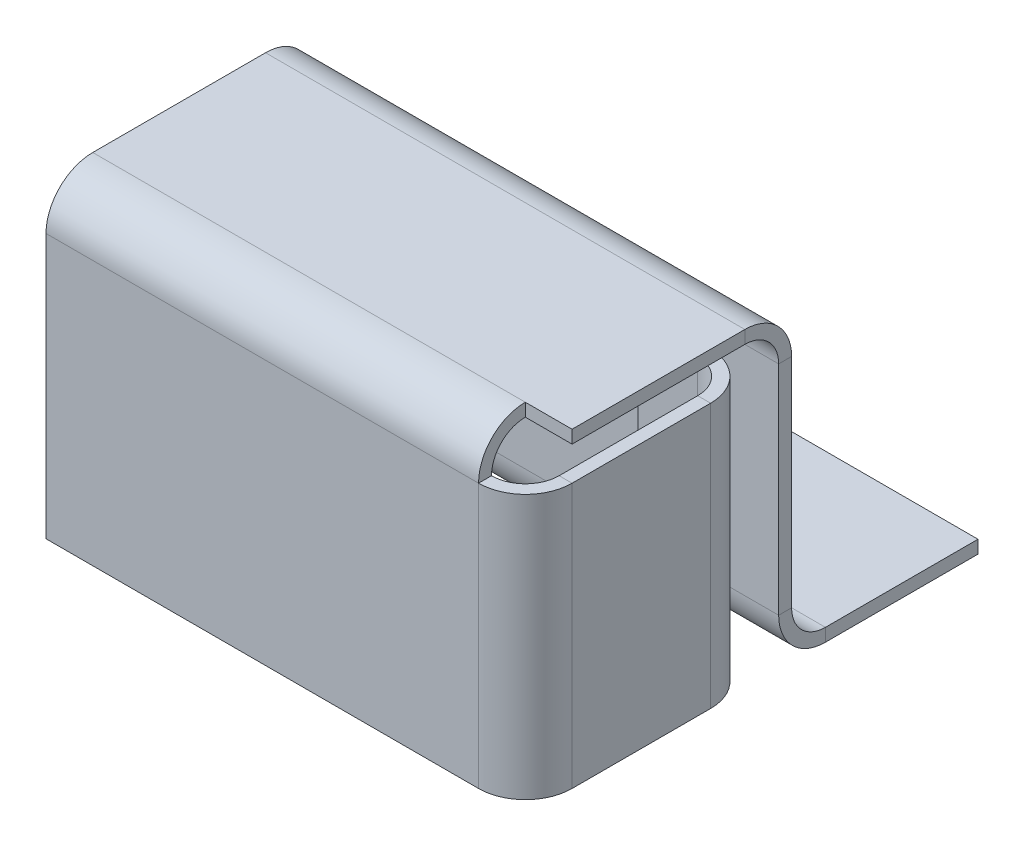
ISO-10303-21;
HEADER;
FILE_DESCRIPTION(('STEP AP214'),'2;1');
FILE_NAME('part.step','',(''),(''),'','','');
FILE_SCHEMA(('AUTOMOTIVE_DESIGN { 1 0 10303 214 1 1 1 1 }'));
ENDSEC;
DATA;
#1=APPLICATION_CONTEXT('core data for automotive mechanical design processes');
#2=APPLICATION_PROTOCOL_DEFINITION('international standard','automotive_design',2000,#1);
#3=PRODUCT_CONTEXT('',#1,'mechanical');
#4=PRODUCT('Part','Part','',(#3));
#5=PRODUCT_RELATED_PRODUCT_CATEGORY('part','',(#4));
#6=PRODUCT_DEFINITION_FORMATION('','',#4);
#7=PRODUCT_DEFINITION_CONTEXT('part definition',#1,'design');
#8=PRODUCT_DEFINITION('design','',#6,#7);
#9=PRODUCT_DEFINITION_SHAPE('','',#8);
#10=(LENGTH_UNIT() NAMED_UNIT(*) SI_UNIT(.MILLI.,.METRE.));
#11=(NAMED_UNIT(*) PLANE_ANGLE_UNIT() SI_UNIT($,.RADIAN.));
#12=(NAMED_UNIT(*) SI_UNIT($,.STERADIAN.) SOLID_ANGLE_UNIT());
#13=UNCERTAINTY_MEASURE_WITH_UNIT(LENGTH_MEASURE(1.E-05),#10,'distance_accuracy_value','');
#14=(GEOMETRIC_REPRESENTATION_CONTEXT(3) GLOBAL_UNCERTAINTY_ASSIGNED_CONTEXT((#13)) GLOBAL_UNIT_ASSIGNED_CONTEXT((#10,
#11,#12)) REPRESENTATION_CONTEXT('',''));
#15=CARTESIAN_POINT('',(0.,0.,0.));
#16=DIRECTION('',(0.,0.,1.));
#17=DIRECTION('',(1.,0.,0.));
#18=AXIS2_PLACEMENT_3D('',#15,#16,#17);
#19=CARTESIAN_POINT('',(45.,23.61088,41.28588));
#20=DIRECTION('',(0.,-1.,0.));
#21=DIRECTION('',(0.,0.,-1.));
#22=AXIS2_PLACEMENT_3D('',#19,#20,#21);
#23=PLANE('',#22);
#24=DIRECTION('',(1.,0.,0.));
#25=VECTOR('',#24,1.);
#26=CARTESIAN_POINT('',(43.7858800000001,23.61088,25.10324));
#27=LINE('',#26,#25);
#28=CARTESIAN_POINT('',(43.7858800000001,23.61088,25.10324));
#29=VERTEX_POINT('',#28);
#30=CARTESIAN_POINT('',(45.0000000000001,23.61088,25.10324));
#31=VERTEX_POINT('',#30);
#32=EDGE_CURVE('E308',#29,#31,#27,.T.);
#33=ORIENTED_EDGE('',*,*,#32,.F.);
#34=DIRECTION('',(0.,0.,-1.));
#35=VECTOR('',#34,1.);
#36=CARTESIAN_POINT('',(43.78588,23.61088,41.28588));
#37=LINE('',#36,#35);
#38=CARTESIAN_POINT('',(43.78588,23.61088,38.11088));
#39=VERTEX_POINT('',#38);
#40=EDGE_CURVE('E321',#29,#39,#37,.F.);
#41=ORIENTED_EDGE('',*,*,#40,.T.);
#42=DIRECTION('',(-1.,0.,0.));
#43=VECTOR('',#42,1.);
#44=CARTESIAN_POINT('',(45.,23.61088,38.11088));
#45=LINE('',#44,#43);
#46=CARTESIAN_POINT('',(45.,23.61088,38.11088));
#47=VERTEX_POINT('',#46);
#48=EDGE_CURVE('E311',#39,#47,#45,.F.);
#49=ORIENTED_EDGE('',*,*,#48,.T.);
#50=DIRECTION('',(0.,0.,1.));
#51=VECTOR('',#50,1.);
#52=CARTESIAN_POINT('',(45.0000000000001,23.61088,1.63988930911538E-13));
#53=LINE('',#52,#51);
#54=EDGE_CURVE('E317',#31,#47,#53,.T.);
#55=ORIENTED_EDGE('',*,*,#54,.F.);
#56=EDGE_LOOP('',(#33,#41,#49,#55));
#57=FACE_BOUND('',#56,.T.);
#58=ADVANCED_FACE('F78',(#57),#23,.F.);
#59=CARTESIAN_POINT('',(45.0000000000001,-1.21412,20.71412));
#60=DIRECTION('',(0.,1.,0.));
#61=DIRECTION('',(0.,0.,1.));
#62=AXIS2_PLACEMENT_3D('',#59,#60,#61);
#63=PLANE('',#62);
#64=DIRECTION('',(1.,0.,0.));
#65=VECTOR('',#64,1.);
#66=CARTESIAN_POINT('',(43.7858800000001,-1.21412,25.10324));
#67=LINE('',#66,#65);
#68=CARTESIAN_POINT('',(43.7858800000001,-1.21412,25.10324));
#69=VERTEX_POINT('',#68);
#70=CARTESIAN_POINT('',(45.0000000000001,-1.21412,25.10324));
#71=VERTEX_POINT('',#70);
#72=EDGE_CURVE('E302',#69,#71,#67,.T.);
#73=ORIENTED_EDGE('',*,*,#72,.T.);
#74=DIRECTION('',(0.,0.,-1.));
#75=VECTOR('',#74,1.);
#76=CARTESIAN_POINT('',(45.0000000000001,-1.21411999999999,1.5547463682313E-13));
#77=LINE('',#76,#75);
#78=CARTESIAN_POINT('',(45.,-1.21412,38.11088));
#79=VERTEX_POINT('',#78);
#80=EDGE_CURVE('E314',#79,#71,#77,.T.);
#81=ORIENTED_EDGE('',*,*,#80,.F.);
#82=DIRECTION('',(-1.,0.,0.));
#83=VECTOR('',#82,1.);
#84=CARTESIAN_POINT('',(43.78588,-1.21412,38.11088));
#85=LINE('',#84,#83);
#86=CARTESIAN_POINT('',(43.78588,-1.21412,38.11088));
#87=VERTEX_POINT('',#86);
#88=EDGE_CURVE('E326',#87,#79,#85,.F.);
#89=ORIENTED_EDGE('',*,*,#88,.F.);
#90=DIRECTION('',(0.,0.,1.));
#91=VECTOR('',#90,1.);
#92=CARTESIAN_POINT('',(43.7858800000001,-1.21412,20.71412));
#93=LINE('',#92,#91);
#94=EDGE_CURVE('E319',#87,#69,#93,.F.);
#95=ORIENTED_EDGE('',*,*,#94,.T.);
#96=EDGE_LOOP('',(#73,#81,#89,#95));
#97=FACE_BOUND('',#96,.T.);
#98=ADVANCED_FACE('F532',(#97),#63,.F.);
#99=CARTESIAN_POINT('',(45.0000000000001,0.,1.56024936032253E-13));
#100=DIRECTION('',(-1.,0.,0.));
#101=DIRECTION('',(0.,0.,1.));
#102=AXIS2_PLACEMENT_3D('',#99,#100,#101);
#103=PLANE('',#102);
#104=DIRECTION('',(0.,-1.,0.));
#105=VECTOR('',#104,1.);
#106=CARTESIAN_POINT('',(45.0000000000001,-1.21412,25.10324));
#107=LINE('',#106,#105);
#108=EDGE_CURVE('E252',#71,#31,#107,.F.);
#109=ORIENTED_EDGE('',*,*,#108,.T.);
#110=ORIENTED_EDGE('',*,*,#54,.T.);
#111=DIRECTION('',(0.,-1.,0.));
#112=VECTOR('',#111,1.);
#113=CARTESIAN_POINT('',(45.,23.61088,38.11088));
#114=LINE('',#113,#112);
#115=EDGE_CURVE('E323',#79,#47,#114,.F.);
#116=ORIENTED_EDGE('',*,*,#115,.F.);
#117=ORIENTED_EDGE('',*,*,#80,.T.);
#118=EDGE_LOOP('',(#109,#110,#116,#117));
#119=FACE_BOUND('',#118,.T.);
#120=ADVANCED_FACE('F528',(#119),#103,.F.);
#121=CARTESIAN_POINT('',(43.7858800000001,0.,1.51785858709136E-13));
#122=DIRECTION('',(-1.,0.,0.));
#123=DIRECTION('',(0.,0.,1.));
#124=AXIS2_PLACEMENT_3D('',#121,#122,#123);
#125=PLANE('',#124);
#126=ORIENTED_EDGE('',*,*,#40,.F.);
#127=DIRECTION('',(0.,-1.,0.));
#128=VECTOR('',#127,1.);
#129=CARTESIAN_POINT('',(43.7858800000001,-1.21412,25.10324));
#130=LINE('',#129,#128);
#131=EDGE_CURVE('E93',#69,#29,#130,.F.);
#132=ORIENTED_EDGE('',*,*,#131,.F.);
#133=ORIENTED_EDGE('',*,*,#94,.F.);
#134=DIRECTION('',(0.,-1.,0.));
#135=VECTOR('',#134,1.);
#136=CARTESIAN_POINT('',(43.78588,23.61088,38.11088));
#137=LINE('',#136,#135);
#138=EDGE_CURVE('E329',#39,#87,#137,.T.);
#139=ORIENTED_EDGE('',*,*,#138,.F.);
#140=EDGE_LOOP('',(#126,#132,#133,#139));
#141=FACE_BOUND('',#140,.T.);
#142=ADVANCED_FACE('F863',(#141),#125,.T.);
#143=CARTESIAN_POINT('',(0.,0.,38.11088));
#144=DIRECTION('',(0.,0.,1.));
#145=DIRECTION('',(1.,0.,0.));
#146=AXIS2_PLACEMENT_3D('',#143,#144,#145);
#147=PLANE('',#146);
#148=DIRECTION('',(0.,1.,0.));
#149=VECTOR('',#148,1.);
#150=CARTESIAN_POINT('',(40.61088,26.78588,38.11088));
#151=LINE('',#150,#149);
#152=CARTESIAN_POINT('',(40.61088,26.78588,38.11088));
#153=VERTEX_POINT('',#152);
#154=CARTESIAN_POINT('',(40.61088,28.,38.11088));
#155=VERTEX_POINT('',#154);
#156=EDGE_CURVE('E13',#153,#155,#151,.T.);
#157=ORIENTED_EDGE('',*,*,#156,.F.);
#158=DIRECTION('',(-1.,0.,0.));
#159=VECTOR('',#158,1.);
#160=CARTESIAN_POINT('',(45.,26.78588,38.11088));
#161=LINE('',#160,#159);
#162=CARTESIAN_POINT('',(45.,26.78588,38.11088));
#163=VERTEX_POINT('',#162);
#164=EDGE_CURVE('E472',#163,#153,#161,.T.);
#165=ORIENTED_EDGE('',*,*,#164,.F.);
#166=DIRECTION('',(0.,-1.,0.));
#167=VECTOR('',#166,1.);
#168=CARTESIAN_POINT('',(45.,28.,38.11088));
#169=LINE('',#168,#167);
#170=CARTESIAN_POINT('',(45.,28.,38.11088));
#171=VERTEX_POINT('',#170);
#172=EDGE_CURVE('E487',#171,#163,#169,.T.);
#173=ORIENTED_EDGE('',*,*,#172,.F.);
#174=DIRECTION('',(-1.,0.,0.));
#175=VECTOR('',#174,1.);
#176=CARTESIAN_POINT('',(45.,28.,38.11088));
#177=LINE('',#176,#175);
#178=EDGE_CURVE('E440',#171,#155,#177,.T.);
#179=ORIENTED_EDGE('',*,*,#178,.T.);
#180=EDGE_LOOP('',(#157,#165,#173,#179));
#181=FACE_BOUND('',#180,.T.);
#182=ADVANCED_FACE('F80',(#181),#147,.T.);
#183=CARTESIAN_POINT('',(45.,23.61088,38.11088));
#184=DIRECTION('',(-1.,0.,0.));
#185=DIRECTION('',(0.,0.,1.));
#186=AXIS2_PLACEMENT_3D('',#183,#184,#185);
#187=CYLINDRICAL_SURFACE('',#186,3.175);
#188=CARTESIAN_POINT('',(0.,26.78588,38.11088));
#189=VERTEX_POINT('',#188);
#190=EDGE_CURVE('E471',#153,#189,#161,.T.);
#191=ORIENTED_EDGE('',*,*,#190,.F.);
#192=CARTESIAN_POINT('',(40.61088,23.61088,38.11088));
#193=DIRECTION('',(1.,0.,0.));
#194=DIRECTION('',(0.,0.,-1.));
#195=AXIS2_PLACEMENT_3D('',#192,#193,#194);
#196=CIRCLE('',#195,3.175);
#197=CARTESIAN_POINT('',(40.61088,23.61088,41.28588));
#198=VERTEX_POINT('',#197);
#199=EDGE_CURVE('E505',#153,#198,#196,.T.);
#200=ORIENTED_EDGE('',*,*,#199,.T.);
#201=DIRECTION('',(-1.,0.,0.));
#202=VECTOR('',#201,1.);
#203=CARTESIAN_POINT('',(45.,23.61088,41.28588));
#204=LINE('',#203,#202);
#205=CARTESIAN_POINT('',(0.,23.61088,41.28588));
#206=VERTEX_POINT('',#205);
#207=EDGE_CURVE('E475',#198,#206,#204,.T.);
#208=ORIENTED_EDGE('',*,*,#207,.T.);
#209=CARTESIAN_POINT('',(0.,23.61088,38.11088));
#210=DIRECTION('',(1.,0.,0.));
#211=DIRECTION('',(0.,0.,-1.));
#212=AXIS2_PLACEMENT_3D('',#209,#210,#211);
#213=CIRCLE('',#212,3.175);
#214=EDGE_CURVE('E400',#189,#206,#213,.T.);
#215=ORIENTED_EDGE('',*,*,#214,.F.);
#216=EDGE_LOOP('',(#191,#200,#208,#215));
#217=FACE_BOUND('',#216,.T.);
#218=ADVANCED_FACE('F626',(#217),#187,.F.);
#219=CARTESIAN_POINT('',(45.,28.,42.5));
#220=DIRECTION('',(0.,0.,-1.));
#221=DIRECTION('',(0.,1.,0.));
#222=AXIS2_PLACEMENT_3D('',#219,#220,#221);
#223=PLANE('',#222);
#224=DIRECTION('',(0.,-1.,0.));
#225=VECTOR('',#224,1.);
#226=CARTESIAN_POINT('',(40.61088,-1.21412000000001,42.5));
#227=LINE('',#226,#225);
#228=CARTESIAN_POINT('',(40.61088,-1.21412000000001,42.5));
#229=VERTEX_POINT('',#228);
#230=CARTESIAN_POINT('',(40.61088,23.61088,42.5));
#231=VERTEX_POINT('',#230);
#232=EDGE_CURVE('E333',#229,#231,#227,.F.);
#233=ORIENTED_EDGE('',*,*,#232,.T.);
#234=DIRECTION('',(-1.,0.,0.));
#235=VECTOR('',#234,1.);
#236=CARTESIAN_POINT('',(45.,23.61088,42.5));
#237=LINE('',#236,#235);
#238=CARTESIAN_POINT('',(0.,23.61088,42.5));
#239=VERTEX_POINT('',#238);
#240=EDGE_CURVE('E391',#231,#239,#237,.T.);
#241=ORIENTED_EDGE('',*,*,#240,.T.);
#242=DIRECTION('',(0.,-1.,0.));
#243=VECTOR('',#242,1.);
#244=CARTESIAN_POINT('',(0.,28.,42.5));
#245=LINE('',#244,#243);
#246=CARTESIAN_POINT('',(0.,-1.21412000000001,42.5));
#247=VERTEX_POINT('',#246);
#248=EDGE_CURVE('E354',#239,#247,#245,.T.);
#249=ORIENTED_EDGE('',*,*,#248,.T.);
#250=DIRECTION('',(-1.,0.,0.));
#251=VECTOR('',#250,1.);
#252=CARTESIAN_POINT('',(45.,-1.21412000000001,42.5));
#253=LINE('',#252,#251);
#254=EDGE_CURVE('E479',#229,#247,#253,.T.);
#255=ORIENTED_EDGE('',*,*,#254,.F.);
#256=EDGE_LOOP('',(#233,#241,#249,#255));
#257=FACE_BOUND('',#256,.T.);
#258=ADVANCED_FACE('F513',(#257),#223,.F.);
#259=CARTESIAN_POINT('',(45.,-1.21412000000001,41.28588));
#260=DIRECTION('',(0.,-1.,0.));
#261=DIRECTION('',(0.,0.,-1.));
#262=AXIS2_PLACEMENT_3D('',#259,#260,#261);
#263=PLANE('',#262);
#264=DIRECTION('',(-1.,0.,0.));
#265=VECTOR('',#264,1.);
#266=CARTESIAN_POINT('',(45.,-1.21412000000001,41.28588));
#267=LINE('',#266,#265);
#268=CARTESIAN_POINT('',(40.61088,-1.21412000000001,41.28588));
#269=VERTEX_POINT('',#268);
#270=CARTESIAN_POINT('',(0.,-1.21412000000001,41.28588));
#271=VERTEX_POINT('',#270);
#272=EDGE_CURVE('E477',#269,#271,#267,.T.);
#273=ORIENTED_EDGE('',*,*,#272,.F.);
#274=DIRECTION('',(0.,0.,1.));
#275=VECTOR('',#274,1.);
#276=CARTESIAN_POINT('',(40.61088,-1.21412000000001,41.28588));
#277=LINE('',#276,#275);
#278=EDGE_CURVE('E340',#269,#229,#277,.T.);
#279=ORIENTED_EDGE('',*,*,#278,.T.);
#280=ORIENTED_EDGE('',*,*,#254,.T.);
#281=DIRECTION('',(0.,0.,1.));
#282=VECTOR('',#281,1.);
#283=CARTESIAN_POINT('',(0.,-1.21412000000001,41.28588));
#284=LINE('',#283,#282);
#285=EDGE_CURVE('E394',#271,#247,#284,.T.);
#286=ORIENTED_EDGE('',*,*,#285,.F.);
#287=EDGE_LOOP('',(#273,#279,#280,#286));
#288=FACE_BOUND('',#287,.T.);
#289=ADVANCED_FACE('F634',(#288),#263,.T.);
#290=CARTESIAN_POINT('',(45.,28.,41.28588));
#291=DIRECTION('',(0.,0.,-1.));
#292=DIRECTION('',(0.,1.,0.));
#293=AXIS2_PLACEMENT_3D('',#290,#291,#292);
#294=PLANE('',#293);
#295=ORIENTED_EDGE('',*,*,#207,.F.);
#296=DIRECTION('',(0.,-1.,0.));
#297=VECTOR('',#296,1.);
#298=CARTESIAN_POINT('',(40.61088,-1.21412000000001,41.28588));
#299=LINE('',#298,#297);
#300=EDGE_CURVE('E346',#269,#198,#299,.F.);
#301=ORIENTED_EDGE('',*,*,#300,.F.);
#302=ORIENTED_EDGE('',*,*,#272,.T.);
#303=DIRECTION('',(0.,-1.,0.));
#304=VECTOR('',#303,1.);
#305=CARTESIAN_POINT('',(0.,28.,41.28588));
#306=LINE('',#305,#304);
#307=EDGE_CURVE('E397',#206,#271,#306,.T.);
#308=ORIENTED_EDGE('',*,*,#307,.F.);
#309=EDGE_LOOP('',(#295,#301,#302,#308));
#310=FACE_BOUND('',#309,.T.);
#311=ADVANCED_FACE('F630',(#310),#294,.T.);
#312=CARTESIAN_POINT('',(45.,0.,14.325));
#313=DIRECTION('',(1.,0.,0.));
#314=DIRECTION('',(0.,0.,-1.));
#315=AXIS2_PLACEMENT_3D('',#312,#313,#314);
#316=PLANE('',#315);
#317=DIRECTION('',(0.,-1.,0.));
#318=VECTOR('',#317,1.);
#319=CARTESIAN_POINT('',(45.,0.,14.325));
#320=LINE('',#319,#318);
#321=CARTESIAN_POINT('',(45.,0.,14.325));
#322=VERTEX_POINT('',#321);
#323=CARTESIAN_POINT('',(45.,-1.21412,14.325));
#324=VERTEX_POINT('',#323);
#325=EDGE_CURVE('E503',#322,#324,#320,.T.);
#326=ORIENTED_EDGE('',*,*,#325,.F.);
#327=CARTESIAN_POINT('',(45.,3.175,14.325));
#328=DIRECTION('',(1.,0.,0.));
#329=DIRECTION('',(0.,0.,-1.));
#330=AXIS2_PLACEMENT_3D('',#327,#328,#329);
#331=CIRCLE('',#330,3.175);
#332=CARTESIAN_POINT('',(45.,3.175,17.5));
#333=VERTEX_POINT('',#332);
#334=EDGE_CURVE('E379',#322,#333,#331,.F.);
#335=ORIENTED_EDGE('',*,*,#334,.T.);
#336=DIRECTION('',(0.,0.,-1.));
#337=VECTOR('',#336,1.);
#338=CARTESIAN_POINT('',(45.,3.175,18.71412));
#339=LINE('',#338,#337);
#340=CARTESIAN_POINT('',(45.,3.175,18.71412));
#341=VERTEX_POINT('',#340);
#342=EDGE_CURVE('E501',#341,#333,#339,.T.);
#343=ORIENTED_EDGE('',*,*,#342,.F.);
#344=CARTESIAN_POINT('',(45.,3.175,14.325));
#345=DIRECTION('',(1.,0.,0.));
#346=DIRECTION('',(0.,0.,-1.));
#347=AXIS2_PLACEMENT_3D('',#344,#345,#346);
#348=CIRCLE('',#347,4.38912);
#349=EDGE_CURVE('E367',#324,#341,#348,.F.);
#350=ORIENTED_EDGE('',*,*,#349,.F.);
#351=EDGE_LOOP('',(#326,#335,#343,#350));
#352=FACE_BOUND('',#351,.T.);
#353=ADVANCED_FACE('F633',(#352),#316,.T.);
#354=CARTESIAN_POINT('',(45.,3.175,18.71412));
#355=DIRECTION('',(1.,0.,0.));
#356=DIRECTION('',(0.,0.,-1.));
#357=AXIS2_PLACEMENT_3D('',#354,#355,#356);
#358=PLANE('',#357);
#359=DIRECTION('',(0.,0.,1.));
#360=VECTOR('',#359,1.);
#361=CARTESIAN_POINT('',(45.,0.,0.));
#362=LINE('',#361,#360);
#363=CARTESIAN_POINT('',(45.,0.,0.));
#364=VERTEX_POINT('',#363);
#365=EDGE_CURVE('E376',#364,#322,#362,.T.);
#366=ORIENTED_EDGE('',*,*,#365,.T.);
#367=ORIENTED_EDGE('',*,*,#325,.T.);
#368=DIRECTION('',(0.,0.,1.));
#369=VECTOR('',#368,1.);
#370=CARTESIAN_POINT('',(45.,-1.21412,0.));
#371=LINE('',#370,#369);
#372=CARTESIAN_POINT('',(45.,-1.21412,0.));
#373=VERTEX_POINT('',#372);
#374=EDGE_CURVE('E370',#373,#324,#371,.T.);
#375=ORIENTED_EDGE('',*,*,#374,.F.);
#376=DIRECTION('',(0.,-1.,0.));
#377=VECTOR('',#376,1.);
#378=CARTESIAN_POINT('',(45.,0.,0.));
#379=LINE('',#378,#377);
#380=EDGE_CURVE('E373',#364,#373,#379,.T.);
#381=ORIENTED_EDGE('',*,*,#380,.F.);
#382=EDGE_LOOP('',(#366,#367,#375,#381));
#383=FACE_BOUND('',#382,.T.);
#384=ADVANCED_FACE('F676',(#383),#358,.T.);
#385=CARTESIAN_POINT('',(0.,3.175,17.5));
#386=DIRECTION('',(-1.,0.,0.));
#387=DIRECTION('',(0.,0.,1.));
#388=AXIS2_PLACEMENT_3D('',#385,#386,#387);
#389=PLANE('',#388);
#390=DIRECTION('',(0.,0.,1.));
#391=VECTOR('',#390,1.);
#392=CARTESIAN_POINT('',(0.,3.175,17.5));
#393=LINE('',#392,#391);
#394=CARTESIAN_POINT('',(0.,3.175,17.5));
#395=VERTEX_POINT('',#394);
#396=CARTESIAN_POINT('',(0.,3.175,18.71412));
#397=VERTEX_POINT('',#396);
#398=EDGE_CURVE('E499',#395,#397,#393,.T.);
#399=ORIENTED_EDGE('',*,*,#398,.F.);
#400=CARTESIAN_POINT('',(0.,3.175,14.325));
#401=DIRECTION('',(1.,0.,0.));
#402=DIRECTION('',(0.,0.,-1.));
#403=AXIS2_PLACEMENT_3D('',#400,#401,#402);
#404=CIRCLE('',#403,3.175);
#405=CARTESIAN_POINT('',(0.,0.,14.325));
#406=VERTEX_POINT('',#405);
#407=EDGE_CURVE('E424',#406,#395,#404,.F.);
#408=ORIENTED_EDGE('',*,*,#407,.F.);
#409=DIRECTION('',(0.,1.,0.));
#410=VECTOR('',#409,1.);
#411=CARTESIAN_POINT('',(0.,-1.21412,14.325));
#412=LINE('',#411,#410);
#413=CARTESIAN_POINT('',(0.,-1.21412,14.325));
#414=VERTEX_POINT('',#413);
#415=EDGE_CURVE('E497',#414,#406,#412,.T.);
#416=ORIENTED_EDGE('',*,*,#415,.F.);
#417=CARTESIAN_POINT('',(0.,3.175,14.325));
#418=DIRECTION('',(1.,0.,0.));
#419=DIRECTION('',(0.,0.,-1.));
#420=AXIS2_PLACEMENT_3D('',#417,#418,#419);
#421=CIRCLE('',#420,4.38912);
#422=EDGE_CURVE('E412',#414,#397,#421,.F.);
#423=ORIENTED_EDGE('',*,*,#422,.T.);
#424=EDGE_LOOP('',(#399,#408,#416,#423));
#425=FACE_BOUND('',#424,.T.);
#426=ADVANCED_FACE('F672',(#425),#389,.T.);
#427=CARTESIAN_POINT('',(0.,-1.21412,14.325));
#428=DIRECTION('',(-1.,0.,0.));
#429=DIRECTION('',(0.,0.,1.));
#430=AXIS2_PLACEMENT_3D('',#427,#428,#429);
#431=PLANE('',#430);
#432=DIRECTION('',(0.,1.,0.));
#433=VECTOR('',#432,1.);
#434=CARTESIAN_POINT('',(0.,0.,17.5));
#435=LINE('',#434,#433);
#436=CARTESIAN_POINT('',(0.,23.61088,17.5));
#437=VERTEX_POINT('',#436);
#438=EDGE_CURVE('E427',#395,#437,#435,.T.);
#439=ORIENTED_EDGE('',*,*,#438,.F.);
#440=ORIENTED_EDGE('',*,*,#398,.T.);
#441=DIRECTION('',(0.,1.,0.));
#442=VECTOR('',#441,1.);
#443=CARTESIAN_POINT('',(0.,0.,18.71412));
#444=LINE('',#443,#442);
#445=CARTESIAN_POINT('',(0.,23.61088,18.71412));
#446=VERTEX_POINT('',#445);
#447=EDGE_CURVE('E409',#397,#446,#444,.T.);
#448=ORIENTED_EDGE('',*,*,#447,.T.);
#449=DIRECTION('',(0.,0.,-1.));
#450=VECTOR('',#449,1.);
#451=CARTESIAN_POINT('',(0.,23.61088,18.71412));
#452=LINE('',#451,#450);
#453=EDGE_CURVE('E489',#446,#437,#452,.T.);
#454=ORIENTED_EDGE('',*,*,#453,.T.);
#455=EDGE_LOOP('',(#439,#440,#448,#454));
#456=FACE_BOUND('',#455,.T.);
#457=ADVANCED_FACE('F668',(#456),#431,.T.);
#458=CARTESIAN_POINT('',(45.,23.61088,17.5));
#459=DIRECTION('',(1.,0.,0.));
#460=DIRECTION('',(0.,0.,-1.));
#461=AXIS2_PLACEMENT_3D('',#458,#459,#460);
#462=PLANE('',#461);
#463=DIRECTION('',(0.,0.,1.));
#464=VECTOR('',#463,1.);
#465=CARTESIAN_POINT('',(45.,23.61088,17.5));
#466=LINE('',#465,#464);
#467=CARTESIAN_POINT('',(45.,23.61088,17.5));
#468=VERTEX_POINT('',#467);
#469=CARTESIAN_POINT('',(45.,23.61088,18.71412));
#470=VERTEX_POINT('',#469);
#471=EDGE_CURVE('E495',#468,#470,#466,.T.);
#472=ORIENTED_EDGE('',*,*,#471,.F.);
#473=CARTESIAN_POINT('',(45.,23.61088,21.88912));
#474=DIRECTION('',(-1.,0.,0.));
#475=DIRECTION('',(0.,0.,1.));
#476=AXIS2_PLACEMENT_3D('',#473,#474,#475);
#477=CIRCLE('',#476,4.38912);
#478=CARTESIAN_POINT('',(45.,28.,21.88912));
#479=VERTEX_POINT('',#478);
#480=EDGE_CURVE('E385',#468,#479,#477,.F.);
#481=ORIENTED_EDGE('',*,*,#480,.T.);
#482=DIRECTION('',(0.,1.,0.));
#483=VECTOR('',#482,1.);
#484=CARTESIAN_POINT('',(45.,26.78588,21.88912));
#485=LINE('',#484,#483);
#486=CARTESIAN_POINT('',(45.,26.78588,21.88912));
#487=VERTEX_POINT('',#486);
#488=EDGE_CURVE('E493',#487,#479,#485,.T.);
#489=ORIENTED_EDGE('',*,*,#488,.F.);
#490=CARTESIAN_POINT('',(45.,23.61088,21.88912));
#491=DIRECTION('',(1.,0.,0.));
#492=DIRECTION('',(0.,0.,-1.));
#493=AXIS2_PLACEMENT_3D('',#490,#491,#492);
#494=CIRCLE('',#493,3.175);
#495=EDGE_CURVE('E360',#470,#487,#494,.T.);
#496=ORIENTED_EDGE('',*,*,#495,.F.);
#497=EDGE_LOOP('',(#472,#481,#489,#496));
#498=FACE_BOUND('',#497,.T.);
#499=ADVANCED_FACE('F664',(#498),#462,.T.);
#500=CARTESIAN_POINT('',(45.,26.78588,21.88912));
#501=DIRECTION('',(1.,0.,0.));
#502=DIRECTION('',(0.,0.,-1.));
#503=AXIS2_PLACEMENT_3D('',#500,#501,#502);
#504=PLANE('',#503);
#505=DIRECTION('',(0.,1.,0.));
#506=VECTOR('',#505,1.);
#507=CARTESIAN_POINT('',(45.,0.,17.5));
#508=LINE('',#507,#506);
#509=EDGE_CURVE('E382',#333,#468,#508,.T.);
#510=ORIENTED_EDGE('',*,*,#509,.T.);
#511=ORIENTED_EDGE('',*,*,#471,.T.);
#512=DIRECTION('',(0.,1.,0.));
#513=VECTOR('',#512,1.);
#514=CARTESIAN_POINT('',(45.,0.,18.71412));
#515=LINE('',#514,#513);
#516=EDGE_CURVE('E364',#341,#470,#515,.T.);
#517=ORIENTED_EDGE('',*,*,#516,.F.);
#518=ORIENTED_EDGE('',*,*,#342,.T.);
#519=EDGE_LOOP('',(#510,#511,#517,#518));
#520=FACE_BOUND('',#519,.T.);
#521=ADVANCED_FACE('F660',(#520),#504,.T.);
#522=CARTESIAN_POINT('',(0.,28.,21.88912));
#523=DIRECTION('',(-1.,0.,0.));
#524=DIRECTION('',(0.,0.,1.));
#525=AXIS2_PLACEMENT_3D('',#522,#523,#524);
#526=PLANE('',#525);
#527=DIRECTION('',(0.,-1.,0.));
#528=VECTOR('',#527,1.);
#529=CARTESIAN_POINT('',(0.,28.,21.88912));
#530=LINE('',#529,#528);
#531=CARTESIAN_POINT('',(0.,28.,21.88912));
#532=VERTEX_POINT('',#531);
#533=CARTESIAN_POINT('',(0.,26.78588,21.88912));
#534=VERTEX_POINT('',#533);
#535=EDGE_CURVE('E491',#532,#534,#530,.T.);
#536=ORIENTED_EDGE('',*,*,#535,.F.);
#537=CARTESIAN_POINT('',(0.,23.61088,21.88912));
#538=DIRECTION('',(-1.,0.,0.));
#539=DIRECTION('',(0.,0.,1.));
#540=AXIS2_PLACEMENT_3D('',#537,#538,#539);
#541=CIRCLE('',#540,4.38912);
#542=EDGE_CURVE('E430',#437,#532,#541,.F.);
#543=ORIENTED_EDGE('',*,*,#542,.F.);
#544=ORIENTED_EDGE('',*,*,#453,.F.);
#545=CARTESIAN_POINT('',(0.,23.61088,21.88912));
#546=DIRECTION('',(1.,0.,0.));
#547=DIRECTION('',(0.,0.,-1.));
#548=AXIS2_PLACEMENT_3D('',#545,#546,#547);
#549=CIRCLE('',#548,3.175);
#550=EDGE_CURVE('E406',#446,#534,#549,.T.);
#551=ORIENTED_EDGE('',*,*,#550,.T.);
#552=EDGE_LOOP('',(#536,#543,#544,#551));
#553=FACE_BOUND('',#552,.T.);
#554=ADVANCED_FACE('F656',(#553),#526,.T.);
#555=CARTESIAN_POINT('',(0.,23.61088,18.71412));
#556=DIRECTION('',(-1.,0.,0.));
#557=DIRECTION('',(0.,0.,1.));
#558=AXIS2_PLACEMENT_3D('',#555,#556,#557);
#559=PLANE('',#558);
#560=DIRECTION('',(0.,0.,1.));
#561=VECTOR('',#560,1.);
#562=CARTESIAN_POINT('',(0.,28.,17.5));
#563=LINE('',#562,#561);
#564=CARTESIAN_POINT('',(0.,28.,38.11088));
#565=VERTEX_POINT('',#564);
#566=EDGE_CURVE('E433',#532,#565,#563,.T.);
#567=ORIENTED_EDGE('',*,*,#566,.F.);
#568=ORIENTED_EDGE('',*,*,#535,.T.);
#569=DIRECTION('',(0.,0.,1.));
#570=VECTOR('',#569,1.);
#571=CARTESIAN_POINT('',(0.,26.78588,17.5));
#572=LINE('',#571,#570);
#573=EDGE_CURVE('E403',#534,#189,#572,.T.);
#574=ORIENTED_EDGE('',*,*,#573,.T.);
#575=DIRECTION('',(0.,1.,0.));
#576=VECTOR('',#575,1.);
#577=CARTESIAN_POINT('',(0.,26.78588,38.11088));
#578=LINE('',#577,#576);
#579=EDGE_CURVE('E481',#189,#565,#578,.T.);
#580=ORIENTED_EDGE('',*,*,#579,.T.);
#581=EDGE_LOOP('',(#567,#568,#574,#580));
#582=FACE_BOUND('',#581,.T.);
#583=ADVANCED_FACE('F652',(#582),#559,.T.);
#584=CARTESIAN_POINT('',(45.,23.61088,41.28588));
#585=DIRECTION('',(1.,0.,0.));
#586=DIRECTION('',(0.,0.,-1.));
#587=AXIS2_PLACEMENT_3D('',#584,#585,#586);
#588=PLANE('',#587);
#589=DIRECTION('',(0.,0.,1.));
#590=VECTOR('',#589,1.);
#591=CARTESIAN_POINT('',(45.,28.,17.5));
#592=LINE('',#591,#590);
#593=EDGE_CURVE('E388',#479,#171,#592,.T.);
#594=ORIENTED_EDGE('',*,*,#593,.T.);
#595=ORIENTED_EDGE('',*,*,#172,.T.);
#596=DIRECTION('',(0.,0.,1.));
#597=VECTOR('',#596,1.);
#598=CARTESIAN_POINT('',(45.,26.78588,17.5));
#599=LINE('',#598,#597);
#600=EDGE_CURVE('E357',#487,#163,#599,.T.);
#601=ORIENTED_EDGE('',*,*,#600,.F.);
#602=ORIENTED_EDGE('',*,*,#488,.T.);
#603=EDGE_LOOP('',(#594,#595,#601,#602));
#604=FACE_BOUND('',#603,.T.);
#605=ADVANCED_FACE('F648',(#604),#588,.T.);
#606=CARTESIAN_POINT('',(0.,23.61088,42.5));
#607=DIRECTION('',(-1.,0.,0.));
#608=DIRECTION('',(0.,0.,1.));
#609=AXIS2_PLACEMENT_3D('',#606,#607,#608);
#610=PLANE('',#609);
#611=DIRECTION('',(0.,0.,-1.));
#612=VECTOR('',#611,1.);
#613=CARTESIAN_POINT('',(0.,23.61088,42.5));
#614=LINE('',#613,#612);
#615=EDGE_CURVE('E484',#239,#206,#614,.T.);
#616=ORIENTED_EDGE('',*,*,#615,.F.);
#617=CARTESIAN_POINT('',(0.,23.61088,38.11088));
#618=DIRECTION('',(-1.,0.,0.));
#619=DIRECTION('',(0.,0.,1.));
#620=AXIS2_PLACEMENT_3D('',#617,#618,#619);
#621=CIRCLE('',#620,4.38912);
#622=EDGE_CURVE('E361',#565,#239,#621,.F.);
#623=ORIENTED_EDGE('',*,*,#622,.F.);
#624=ORIENTED_EDGE('',*,*,#579,.F.);
#625=ORIENTED_EDGE('',*,*,#214,.T.);
#626=EDGE_LOOP('',(#616,#623,#624,#625));
#627=FACE_BOUND('',#626,.T.);
#628=ADVANCED_FACE('F644',(#627),#610,.T.);
#629=CARTESIAN_POINT('',(0.,26.78588,38.11088));
#630=DIRECTION('',(-1.,0.,0.));
#631=DIRECTION('',(0.,0.,1.));
#632=AXIS2_PLACEMENT_3D('',#629,#630,#631);
#633=PLANE('',#632);
#634=ORIENTED_EDGE('',*,*,#248,.F.);
#635=ORIENTED_EDGE('',*,*,#615,.T.);
#636=ORIENTED_EDGE('',*,*,#307,.T.);
#637=ORIENTED_EDGE('',*,*,#285,.T.);
#638=EDGE_LOOP('',(#634,#635,#636,#637));
#639=FACE_BOUND('',#638,.T.);
#640=ADVANCED_FACE('F641',(#639),#633,.T.);
#641=CARTESIAN_POINT('',(40.61088,23.61088,38.11088));
#642=DIRECTION('',(1.,0.,0.));
#643=DIRECTION('',(0.,0.,-1.));
#644=AXIS2_PLACEMENT_3D('',#641,#642,#643);
#645=PLANE('',#644);
#646=ORIENTED_EDGE('',*,*,#199,.F.);
#647=ORIENTED_EDGE('',*,*,#156,.T.);
#648=CARTESIAN_POINT('',(40.61088,23.61088,38.11088));
#649=DIRECTION('',(1.,0.,0.));
#650=DIRECTION('',(0.,0.,-1.));
#651=AXIS2_PLACEMENT_3D('',#648,#649,#650);
#652=CIRCLE('',#651,4.38912);
#653=EDGE_CURVE('E86',#155,#231,#652,.T.);
#654=ORIENTED_EDGE('',*,*,#653,.T.);
#655=DIRECTION('',(0.,0.,1.));
#656=VECTOR('',#655,1.);
#657=CARTESIAN_POINT('',(40.61088,23.61088,41.28588));
#658=LINE('',#657,#656);
#659=EDGE_CURVE('E351',#198,#231,#658,.T.);
#660=ORIENTED_EDGE('',*,*,#659,.F.);
#661=EDGE_LOOP('',(#646,#647,#654,#660));
#662=FACE_BOUND('',#661,.T.);
#663=ADVANCED_FACE('F507',(#662),#645,.T.);
#664=CARTESIAN_POINT('',(45.,26.78588,17.5));
#665=DIRECTION('',(0.,-1.,0.));
#666=DIRECTION('',(0.,0.,-1.));
#667=AXIS2_PLACEMENT_3D('',#664,#665,#666);
#668=PLANE('',#667);
#669=ORIENTED_EDGE('',*,*,#573,.F.);
#670=DIRECTION('',(-1.,0.,0.));
#671=VECTOR('',#670,1.);
#672=CARTESIAN_POINT('',(45.,26.78588,21.88912));
#673=LINE('',#672,#671);
#674=EDGE_CURVE('E468',#487,#534,#673,.T.);
#675=ORIENTED_EDGE('',*,*,#674,.F.);
#676=ORIENTED_EDGE('',*,*,#600,.T.);
#677=ORIENTED_EDGE('',*,*,#164,.T.);
#678=ORIENTED_EDGE('',*,*,#190,.T.);
#679=EDGE_LOOP('',(#669,#675,#676,#677,#678));
#680=FACE_BOUND('',#679,.T.);
#681=ADVANCED_FACE('F621',(#680),#668,.T.);
#682=CARTESIAN_POINT('',(45.,23.61088,21.88912));
#683=DIRECTION('',(-1.,0.,0.));
#684=DIRECTION('',(0.,0.,1.));
#685=AXIS2_PLACEMENT_3D('',#682,#683,#684);
#686=CYLINDRICAL_SURFACE('',#685,3.175);
#687=ORIENTED_EDGE('',*,*,#550,.F.);
#688=DIRECTION('',(-1.,0.,0.));
#689=VECTOR('',#688,1.);
#690=CARTESIAN_POINT('',(45.,23.61088,18.71412));
#691=LINE('',#690,#689);
#692=EDGE_CURVE('E465',#470,#446,#691,.T.);
#693=ORIENTED_EDGE('',*,*,#692,.F.);
#694=ORIENTED_EDGE('',*,*,#495,.T.);
#695=ORIENTED_EDGE('',*,*,#674,.T.);
#696=EDGE_LOOP('',(#687,#693,#694,#695));
#697=FACE_BOUND('',#696,.T.);
#698=ADVANCED_FACE('F617',(#697),#686,.F.);
#699=CARTESIAN_POINT('',(45.,0.,18.71412));
#700=DIRECTION('',(0.,0.,1.));
#701=DIRECTION('',(1.,0.,0.));
#702=AXIS2_PLACEMENT_3D('',#699,#700,#701);
#703=PLANE('',#702);
#704=ORIENTED_EDGE('',*,*,#447,.F.);
#705=DIRECTION('',(-1.,0.,0.));
#706=VECTOR('',#705,1.);
#707=CARTESIAN_POINT('',(45.,3.175,18.71412));
#708=LINE('',#707,#706);
#709=EDGE_CURVE('E462',#341,#397,#708,.T.);
#710=ORIENTED_EDGE('',*,*,#709,.F.);
#711=ORIENTED_EDGE('',*,*,#516,.T.);
#712=ORIENTED_EDGE('',*,*,#692,.T.);
#713=EDGE_LOOP('',(#704,#710,#711,#712));
#714=FACE_BOUND('',#713,.T.);
#715=ADVANCED_FACE('F613',(#714),#703,.T.);
#716=CARTESIAN_POINT('',(45.,3.175,14.325));
#717=DIRECTION('',(-1.,0.,0.));
#718=DIRECTION('',(0.,0.,1.));
#719=AXIS2_PLACEMENT_3D('',#716,#717,#718);
#720=CYLINDRICAL_SURFACE('',#719,4.38912);
#721=ORIENTED_EDGE('',*,*,#422,.F.);
#722=DIRECTION('',(-1.,0.,0.));
#723=VECTOR('',#722,1.);
#724=CARTESIAN_POINT('',(45.,-1.21412,14.325));
#725=LINE('',#724,#723);
#726=EDGE_CURVE('E459',#324,#414,#725,.T.);
#727=ORIENTED_EDGE('',*,*,#726,.F.);
#728=ORIENTED_EDGE('',*,*,#349,.T.);
#729=ORIENTED_EDGE('',*,*,#709,.T.);
#730=EDGE_LOOP('',(#721,#727,#728,#729));
#731=FACE_BOUND('',#730,.T.);
#732=ADVANCED_FACE('F609',(#731),#720,.T.);
#733=CARTESIAN_POINT('',(45.,-1.21412,0.));
#734=DIRECTION('',(0.,-1.,0.));
#735=DIRECTION('',(0.,0.,-1.));
#736=AXIS2_PLACEMENT_3D('',#733,#734,#735);
#737=PLANE('',#736);
#738=DIRECTION('',(0.,0.,1.));
#739=VECTOR('',#738,1.);
#740=CARTESIAN_POINT('',(0.,-1.21412,0.));
#741=LINE('',#740,#739);
#742=CARTESIAN_POINT('',(0.,-1.21412,0.));
#743=VERTEX_POINT('',#742);
#744=EDGE_CURVE('E415',#743,#414,#741,.T.);
#745=ORIENTED_EDGE('',*,*,#744,.F.);
#746=DIRECTION('',(-1.,0.,0.));
#747=VECTOR('',#746,1.);
#748=CARTESIAN_POINT('',(45.,-1.21412,0.));
#749=LINE('',#748,#747);
#750=EDGE_CURVE('E457',#373,#743,#749,.T.);
#751=ORIENTED_EDGE('',*,*,#750,.F.);
#752=ORIENTED_EDGE('',*,*,#374,.T.);
#753=ORIENTED_EDGE('',*,*,#726,.T.);
#754=EDGE_LOOP('',(#745,#751,#752,#753));
#755=FACE_BOUND('',#754,.T.);
#756=ADVANCED_FACE('F605',(#755),#737,.T.);
#757=CARTESIAN_POINT('',(45.,0.,0.));
#758=DIRECTION('',(0.,0.,-1.));
#759=DIRECTION('',(0.,1.,0.));
#760=AXIS2_PLACEMENT_3D('',#757,#758,#759);
#761=PLANE('',#760);
#762=DIRECTION('',(0.,-1.,0.));
#763=VECTOR('',#762,1.);
#764=CARTESIAN_POINT('',(0.,0.,0.));
#765=LINE('',#764,#763);
#766=CARTESIAN_POINT('',(0.,0.,0.));
#767=VERTEX_POINT('',#766);
#768=EDGE_CURVE('E418',#767,#743,#765,.T.);
#769=ORIENTED_EDGE('',*,*,#768,.F.);
#770=DIRECTION('',(-1.,0.,0.));
#771=VECTOR('',#770,1.);
#772=CARTESIAN_POINT('',(45.,0.,0.));
#773=LINE('',#772,#771);
#774=EDGE_CURVE('E455',#364,#767,#773,.T.);
#775=ORIENTED_EDGE('',*,*,#774,.F.);
#776=ORIENTED_EDGE('',*,*,#380,.T.);
#777=ORIENTED_EDGE('',*,*,#750,.T.);
#778=EDGE_LOOP('',(#769,#775,#776,#777));
#779=FACE_BOUND('',#778,.T.);
#780=ADVANCED_FACE('F601',(#779),#761,.T.);
#781=CARTESIAN_POINT('',(45.,0.,0.));
#782=DIRECTION('',(0.,-1.,0.));
#783=DIRECTION('',(0.,0.,-1.));
#784=AXIS2_PLACEMENT_3D('',#781,#782,#783);
#785=PLANE('',#784);
#786=DIRECTION('',(0.,0.,1.));
#787=VECTOR('',#786,1.);
#788=CARTESIAN_POINT('',(0.,0.,0.));
#789=LINE('',#788,#787);
#790=EDGE_CURVE('E421',#767,#406,#789,.T.);
#791=ORIENTED_EDGE('',*,*,#790,.T.);
#792=DIRECTION('',(-1.,0.,0.));
#793=VECTOR('',#792,1.);
#794=CARTESIAN_POINT('',(45.,0.,14.325));
#795=LINE('',#794,#793);
#796=EDGE_CURVE('E452',#322,#406,#795,.T.);
#797=ORIENTED_EDGE('',*,*,#796,.F.);
#798=ORIENTED_EDGE('',*,*,#365,.F.);
#799=ORIENTED_EDGE('',*,*,#774,.T.);
#800=EDGE_LOOP('',(#791,#797,#798,#799));
#801=FACE_BOUND('',#800,.T.);
#802=ADVANCED_FACE('F597',(#801),#785,.F.);
#803=CARTESIAN_POINT('',(45.,3.175,14.325));
#804=DIRECTION('',(-1.,0.,0.));
#805=DIRECTION('',(0.,0.,1.));
#806=AXIS2_PLACEMENT_3D('',#803,#804,#805);
#807=CYLINDRICAL_SURFACE('',#806,3.175);
#808=ORIENTED_EDGE('',*,*,#407,.T.);
#809=DIRECTION('',(-1.,0.,0.));
#810=VECTOR('',#809,1.);
#811=CARTESIAN_POINT('',(45.,3.175,17.5));
#812=LINE('',#811,#810);
#813=EDGE_CURVE('E449',#333,#395,#812,.T.);
#814=ORIENTED_EDGE('',*,*,#813,.F.);
#815=ORIENTED_EDGE('',*,*,#334,.F.);
#816=ORIENTED_EDGE('',*,*,#796,.T.);
#817=EDGE_LOOP('',(#808,#814,#815,#816));
#818=FACE_BOUND('',#817,.T.);
#819=ADVANCED_FACE('F593',(#818),#807,.F.);
#820=CARTESIAN_POINT('',(45.,0.,17.5));
#821=DIRECTION('',(0.,0.,1.));
#822=DIRECTION('',(1.,0.,0.));
#823=AXIS2_PLACEMENT_3D('',#820,#821,#822);
#824=PLANE('',#823);
#825=ORIENTED_EDGE('',*,*,#438,.T.);
#826=DIRECTION('',(-1.,0.,0.));
#827=VECTOR('',#826,1.);
#828=CARTESIAN_POINT('',(45.,23.61088,17.5));
#829=LINE('',#828,#827);
#830=EDGE_CURVE('E446',#468,#437,#829,.T.);
#831=ORIENTED_EDGE('',*,*,#830,.F.);
#832=ORIENTED_EDGE('',*,*,#509,.F.);
#833=ORIENTED_EDGE('',*,*,#813,.T.);
#834=EDGE_LOOP('',(#825,#831,#832,#833));
#835=FACE_BOUND('',#834,.T.);
#836=ADVANCED_FACE('F589',(#835),#824,.F.);
#837=CARTESIAN_POINT('',(45.,23.61088,21.88912));
#838=DIRECTION('',(-1.,0.,0.));
#839=DIRECTION('',(0.,0.,1.));
#840=AXIS2_PLACEMENT_3D('',#837,#838,#839);
#841=CYLINDRICAL_SURFACE('',#840,4.38912);
#842=ORIENTED_EDGE('',*,*,#542,.T.);
#843=DIRECTION('',(-1.,0.,0.));
#844=VECTOR('',#843,1.);
#845=CARTESIAN_POINT('',(45.,28.,21.88912));
#846=LINE('',#845,#844);
#847=EDGE_CURVE('E443',#479,#532,#846,.T.);
#848=ORIENTED_EDGE('',*,*,#847,.F.);
#849=ORIENTED_EDGE('',*,*,#480,.F.);
#850=ORIENTED_EDGE('',*,*,#830,.T.);
#851=EDGE_LOOP('',(#842,#848,#849,#850));
#852=FACE_BOUND('',#851,.T.);
#853=ADVANCED_FACE('F585',(#852),#841,.T.);
#854=CARTESIAN_POINT('',(45.,28.,17.5));
#855=DIRECTION('',(0.,-1.,0.));
#856=DIRECTION('',(0.,0.,-1.));
#857=AXIS2_PLACEMENT_3D('',#854,#855,#856);
#858=PLANE('',#857);
#859=ORIENTED_EDGE('',*,*,#566,.T.);
#860=EDGE_CURVE('E439',#155,#565,#177,.T.);
#861=ORIENTED_EDGE('',*,*,#860,.F.);
#862=ORIENTED_EDGE('',*,*,#178,.F.);
#863=ORIENTED_EDGE('',*,*,#593,.F.);
#864=ORIENTED_EDGE('',*,*,#847,.T.);
#865=EDGE_LOOP('',(#859,#861,#862,#863,#864));
#866=FACE_BOUND('',#865,.T.);
#867=ADVANCED_FACE('F582',(#866),#858,.F.);
#868=CARTESIAN_POINT('',(45.,23.61088,38.11088));
#869=DIRECTION('',(-1.,0.,0.));
#870=DIRECTION('',(0.,0.,1.));
#871=AXIS2_PLACEMENT_3D('',#868,#869,#870);
#872=CYLINDRICAL_SURFACE('',#871,4.38912);
#873=ORIENTED_EDGE('',*,*,#653,.F.);
#874=ORIENTED_EDGE('',*,*,#860,.T.);
#875=ORIENTED_EDGE('',*,*,#622,.T.);
#876=ORIENTED_EDGE('',*,*,#240,.F.);
#877=EDGE_LOOP('',(#873,#874,#875,#876));
#878=FACE_BOUND('',#877,.T.);
#879=ADVANCED_FACE('F517',(#878),#872,.T.);
#880=CARTESIAN_POINT('',(0.,23.61088,38.11088));
#881=DIRECTION('',(1.,0.,0.));
#882=DIRECTION('',(0.,0.,-1.));
#883=AXIS2_PLACEMENT_3D('',#880,#881,#882);
#884=PLANE('',#883);
#885=ORIENTED_EDGE('',*,*,#744,.T.);
#886=ORIENTED_EDGE('',*,*,#415,.T.);
#887=ORIENTED_EDGE('',*,*,#790,.F.);
#888=ORIENTED_EDGE('',*,*,#768,.T.);
#889=EDGE_LOOP('',(#885,#886,#887,#888));
#890=FACE_BOUND('',#889,.T.);
#891=ADVANCED_FACE('F573',(#890),#884,.F.);
#892=CARTESIAN_POINT('',(40.61088,23.61088,38.11088));
#893=DIRECTION('',(0.,1.,0.));
#894=DIRECTION('',(0.,0.,1.));
#895=AXIS2_PLACEMENT_3D('',#892,#893,#894);
#896=PLANE('',#895);
#897=ORIENTED_EDGE('',*,*,#48,.F.);
#898=CARTESIAN_POINT('',(40.61088,23.61088,38.11088));
#899=DIRECTION('',(0.,-1.,0.));
#900=DIRECTION('',(0.,0.,-1.));
#901=AXIS2_PLACEMENT_3D('',#898,#899,#900);
#902=CIRCLE('',#901,3.175);
#903=EDGE_CURVE('E343',#198,#39,#902,.F.);
#904=ORIENTED_EDGE('',*,*,#903,.F.);
#905=ORIENTED_EDGE('',*,*,#659,.T.);
#906=CARTESIAN_POINT('',(40.61088,23.61088,38.11088));
#907=DIRECTION('',(0.,-1.,0.));
#908=DIRECTION('',(0.,0.,-1.));
#909=AXIS2_PLACEMENT_3D('',#906,#907,#908);
#910=CIRCLE('',#909,4.38912);
#911=EDGE_CURVE('E336',#231,#47,#910,.F.);
#912=ORIENTED_EDGE('',*,*,#911,.T.);
#913=EDGE_LOOP('',(#897,#904,#905,#912));
#914=FACE_BOUND('',#913,.T.);
#915=ADVANCED_FACE('F523',(#914),#896,.T.);
#916=CARTESIAN_POINT('',(40.61088,-1.21412,38.11088));
#917=DIRECTION('',(0.,1.,0.));
#918=DIRECTION('',(0.,0.,1.));
#919=AXIS2_PLACEMENT_3D('',#916,#917,#918);
#920=PLANE('',#919);
#921=CARTESIAN_POINT('',(40.61088,-1.21412,38.11088));
#922=DIRECTION('',(0.,-1.,0.));
#923=DIRECTION('',(0.,0.,-1.));
#924=AXIS2_PLACEMENT_3D('',#921,#922,#923);
#925=CIRCLE('',#924,3.175);
#926=EDGE_CURVE('E316',#87,#269,#925,.T.);
#927=ORIENTED_EDGE('',*,*,#926,.F.);
#928=ORIENTED_EDGE('',*,*,#88,.T.);
#929=CARTESIAN_POINT('',(40.61088,-1.21412,38.11088));
#930=DIRECTION('',(0.,-1.,0.));
#931=DIRECTION('',(0.,0.,-1.));
#932=AXIS2_PLACEMENT_3D('',#929,#930,#931);
#933=CIRCLE('',#932,4.38912);
#934=EDGE_CURVE('E337',#79,#229,#933,.T.);
#935=ORIENTED_EDGE('',*,*,#934,.T.);
#936=ORIENTED_EDGE('',*,*,#278,.F.);
#937=EDGE_LOOP('',(#927,#928,#935,#936));
#938=FACE_BOUND('',#937,.T.);
#939=ADVANCED_FACE('F566',(#938),#920,.F.);
#940=CARTESIAN_POINT('',(40.61088,-1.21412,38.11088));
#941=DIRECTION('',(0.,-1.,0.));
#942=DIRECTION('',(1.,0.,0.));
#943=AXIS2_PLACEMENT_3D('',#940,#941,#942);
#944=CYLINDRICAL_SURFACE('',#943,4.38912);
#945=ORIENTED_EDGE('',*,*,#232,.F.);
#946=ORIENTED_EDGE('',*,*,#934,.F.);
#947=ORIENTED_EDGE('',*,*,#115,.T.);
#948=ORIENTED_EDGE('',*,*,#911,.F.);
#949=EDGE_LOOP('',(#945,#946,#947,#948));
#950=FACE_BOUND('',#949,.T.);
#951=ADVANCED_FACE('F524',(#950),#944,.T.);
#952=CARTESIAN_POINT('',(40.61088,-1.21412,38.11088));
#953=DIRECTION('',(0.,-1.,0.));
#954=DIRECTION('',(1.,0.,0.));
#955=AXIS2_PLACEMENT_3D('',#952,#953,#954);
#956=CYLINDRICAL_SURFACE('',#955,3.175);
#957=ORIENTED_EDGE('',*,*,#300,.T.);
#958=ORIENTED_EDGE('',*,*,#903,.T.);
#959=ORIENTED_EDGE('',*,*,#138,.T.);
#960=ORIENTED_EDGE('',*,*,#926,.T.);
#961=EDGE_LOOP('',(#957,#958,#959,#960));
#962=FACE_BOUND('',#961,.T.);
#963=ADVANCED_FACE('F565',(#962),#956,.F.);
#964=CARTESIAN_POINT('',(40.6108800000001,23.61088,25.10324));
#965=DIRECTION('',(0.,1.,0.));
#966=DIRECTION('',(0.,0.,1.));
#967=AXIS2_PLACEMENT_3D('',#964,#965,#966);
#968=PLANE('',#967);
#969=DIRECTION('',(0.,0.,-1.));
#970=VECTOR('',#969,1.);
#971=CARTESIAN_POINT('',(40.6108800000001,23.61088,20.71412));
#972=LINE('',#971,#970);
#973=CARTESIAN_POINT('',(40.6108800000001,23.61088,21.92824));
#974=VERTEX_POINT('',#973);
#975=CARTESIAN_POINT('',(40.6108800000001,23.61088,20.71412));
#976=VERTEX_POINT('',#975);
#977=EDGE_CURVE('E297',#974,#976,#972,.T.);
#978=ORIENTED_EDGE('',*,*,#977,.F.);
#979=CARTESIAN_POINT('',(40.6108800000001,23.61088,25.10324));
#980=DIRECTION('',(0.,-1.,0.));
#981=DIRECTION('',(0.,0.,-1.));
#982=AXIS2_PLACEMENT_3D('',#979,#980,#981);
#983=CIRCLE('',#982,3.175);
#984=EDGE_CURVE('E255',#29,#974,#983,.F.);
#985=ORIENTED_EDGE('',*,*,#984,.F.);
#986=ORIENTED_EDGE('',*,*,#32,.T.);
#987=CARTESIAN_POINT('',(40.6108800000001,23.61088,25.10324));
#988=DIRECTION('',(0.,-1.,0.));
#989=DIRECTION('',(0.,0.,-1.));
#990=AXIS2_PLACEMENT_3D('',#987,#988,#989);
#991=CIRCLE('',#990,4.38912);
#992=EDGE_CURVE('E301',#31,#976,#991,.F.);
#993=ORIENTED_EDGE('',*,*,#992,.T.);
#994=EDGE_LOOP('',(#978,#985,#986,#993));
#995=FACE_BOUND('',#994,.T.);
#996=ADVANCED_FACE('F569',(#995),#968,.T.);
#997=CARTESIAN_POINT('',(40.6108800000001,-1.21412,25.10324));
#998=DIRECTION('',(0.,1.,0.));
#999=DIRECTION('',(0.,0.,1.));
#1000=AXIS2_PLACEMENT_3D('',#997,#998,#999);
#1001=PLANE('',#1000);
#1002=CARTESIAN_POINT('',(40.6108800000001,-1.21412,25.10324));
#1003=DIRECTION('',(0.,-1.,0.));
#1004=DIRECTION('',(0.,0.,-1.));
#1005=AXIS2_PLACEMENT_3D('',#1002,#1003,#1004);
#1006=CIRCLE('',#1005,3.175);
#1007=CARTESIAN_POINT('',(40.6108800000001,-1.21412,21.92824));
#1008=VERTEX_POINT('',#1007);
#1009=EDGE_CURVE('E262',#1008,#69,#1006,.T.);
#1010=ORIENTED_EDGE('',*,*,#1009,.F.);
#1011=DIRECTION('',(0.,0.,-1.));
#1012=VECTOR('',#1011,1.);
#1013=CARTESIAN_POINT('',(40.6108800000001,-1.21412,21.92824));
#1014=LINE('',#1013,#1012);
#1015=CARTESIAN_POINT('',(40.6108800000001,-1.21412,20.71412));
#1016=VERTEX_POINT('',#1015);
#1017=EDGE_CURVE('E259',#1008,#1016,#1014,.T.);
#1018=ORIENTED_EDGE('',*,*,#1017,.T.);
#1019=CARTESIAN_POINT('',(40.6108800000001,-1.21412,25.10324));
#1020=DIRECTION('',(0.,-1.,0.));
#1021=DIRECTION('',(0.,0.,-1.));
#1022=AXIS2_PLACEMENT_3D('',#1019,#1020,#1021);
#1023=CIRCLE('',#1022,4.38912);
#1024=EDGE_CURVE('E245',#1016,#71,#1023,.T.);
#1025=ORIENTED_EDGE('',*,*,#1024,.T.);
#1026=ORIENTED_EDGE('',*,*,#72,.F.);
#1027=EDGE_LOOP('',(#1010,#1018,#1025,#1026));
#1028=FACE_BOUND('',#1027,.T.);
#1029=ADVANCED_FACE('F260',(#1028),#1001,.F.);
#1030=CARTESIAN_POINT('',(40.6108800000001,-1.21412,25.10324));
#1031=DIRECTION('',(0.,-1.,0.));
#1032=DIRECTION('',(0.,0.,-1.));
#1033=AXIS2_PLACEMENT_3D('',#1030,#1031,#1032);
#1034=CYLINDRICAL_SURFACE('',#1033,4.38912);
#1035=ORIENTED_EDGE('',*,*,#108,.F.);
#1036=ORIENTED_EDGE('',*,*,#1024,.F.);
#1037=DIRECTION('',(0.,-1.,0.));
#1038=VECTOR('',#1037,1.);
#1039=CARTESIAN_POINT('',(40.6108800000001,0.,20.71412));
#1040=LINE('',#1039,#1038);
#1041=EDGE_CURVE('E250',#976,#1016,#1040,.T.);
#1042=ORIENTED_EDGE('',*,*,#1041,.F.);
#1043=ORIENTED_EDGE('',*,*,#992,.F.);
#1044=EDGE_LOOP('',(#1035,#1036,#1042,#1043));
#1045=FACE_BOUND('',#1044,.T.);
#1046=ADVANCED_FACE('F247',(#1045),#1034,.T.);
#1047=CARTESIAN_POINT('',(40.6108800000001,-1.21412,25.10324));
#1048=DIRECTION('',(0.,-1.,0.));
#1049=DIRECTION('',(0.,0.,-1.));
#1050=AXIS2_PLACEMENT_3D('',#1047,#1048,#1049);
#1051=CYLINDRICAL_SURFACE('',#1050,3.175);
#1052=ORIENTED_EDGE('',*,*,#131,.T.);
#1053=ORIENTED_EDGE('',*,*,#984,.T.);
#1054=DIRECTION('',(0.,1.,0.));
#1055=VECTOR('',#1054,1.);
#1056=CARTESIAN_POINT('',(40.6108800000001,23.61088,21.92824));
#1057=LINE('',#1056,#1055);
#1058=EDGE_CURVE('E267',#974,#1008,#1057,.F.);
#1059=ORIENTED_EDGE('',*,*,#1058,.T.);
#1060=ORIENTED_EDGE('',*,*,#1009,.T.);
#1061=EDGE_LOOP('',(#1052,#1053,#1059,#1060));
#1062=FACE_BOUND('',#1061,.T.);
#1063=ADVANCED_FACE('F534',(#1062),#1051,.F.);
#1064=CARTESIAN_POINT('',(43.7858800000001,-1.21412,20.71412));
#1065=DIRECTION('',(0.,-1.,0.));
#1066=DIRECTION('',(0.,0.,-1.));
#1067=AXIS2_PLACEMENT_3D('',#1064,#1065,#1066);
#1068=PLANE('',#1067);
#1069=DIRECTION('',(1.,0.,0.));
#1070=VECTOR('',#1069,1.);
#1071=CARTESIAN_POINT('',(43.7858800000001,-1.21412,20.71412));
#1072=LINE('',#1071,#1070);
#1073=CARTESIAN_POINT('',(35.0000000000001,-1.21412,20.7141199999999));
#1074=VERTEX_POINT('',#1073);
#1075=EDGE_CURVE('E274',#1074,#1016,#1072,.T.);
#1076=ORIENTED_EDGE('',*,*,#1075,.T.);
#1077=ORIENTED_EDGE('',*,*,#1017,.F.);
#1078=DIRECTION('',(-1.,0.,0.));
#1079=VECTOR('',#1078,1.);
#1080=CARTESIAN_POINT('',(-1.42881775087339E-13,-1.21412000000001,21.9282399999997));
#1081=LINE('',#1080,#1079);
#1082=CARTESIAN_POINT('',(35.,-1.21412,21.9282399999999));
#1083=VERTEX_POINT('',#1082);
#1084=EDGE_CURVE('E290',#1083,#1008,#1081,.F.);
#1085=ORIENTED_EDGE('',*,*,#1084,.F.);
#1086=DIRECTION('',(0.,0.,1.));
#1087=VECTOR('',#1086,1.);
#1088=CARTESIAN_POINT('',(35.0000000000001,-1.21412,20.7141199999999));
#1089=LINE('',#1088,#1087);
#1090=EDGE_CURVE('E279',#1074,#1083,#1089,.T.);
#1091=ORIENTED_EDGE('',*,*,#1090,.F.);
#1092=EDGE_LOOP('',(#1076,#1077,#1085,#1091));
#1093=FACE_BOUND('',#1092,.T.);
#1094=ADVANCED_FACE('F278',(#1093),#1068,.T.);
#1095=CARTESIAN_POINT('',(35.0000000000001,23.61088,20.71412));
#1096=DIRECTION('',(0.,1.,0.));
#1097=DIRECTION('',(0.,0.,1.));
#1098=AXIS2_PLACEMENT_3D('',#1095,#1096,#1097);
#1099=PLANE('',#1098);
#1100=DIRECTION('',(1.,0.,0.));
#1101=VECTOR('',#1100,1.);
#1102=CARTESIAN_POINT('',(-1.43151461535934E-13,23.61088,21.9282399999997));
#1103=LINE('',#1102,#1101);
#1104=CARTESIAN_POINT('',(35.,23.61088,21.9282399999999));
#1105=VERTEX_POINT('',#1104);
#1106=EDGE_CURVE('E276',#974,#1105,#1103,.F.);
#1107=ORIENTED_EDGE('',*,*,#1106,.F.);
#1108=ORIENTED_EDGE('',*,*,#977,.T.);
#1109=DIRECTION('',(-1.,0.,0.));
#1110=VECTOR('',#1109,1.);
#1111=CARTESIAN_POINT('',(35.0000000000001,23.61088,20.71412));
#1112=LINE('',#1111,#1110);
#1113=CARTESIAN_POINT('',(35.0000000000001,23.61088,20.71412));
#1114=VERTEX_POINT('',#1113);
#1115=EDGE_CURVE('E275',#976,#1114,#1112,.T.);
#1116=ORIENTED_EDGE('',*,*,#1115,.T.);
#1117=DIRECTION('',(0.,0.,1.));
#1118=VECTOR('',#1117,1.);
#1119=CARTESIAN_POINT('',(35.0000000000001,23.61088,20.71412));
#1120=LINE('',#1119,#1118);
#1121=EDGE_CURVE('E281',#1114,#1105,#1120,.T.);
#1122=ORIENTED_EDGE('',*,*,#1121,.T.);
#1123=EDGE_LOOP('',(#1107,#1108,#1116,#1122));
#1124=FACE_BOUND('',#1123,.T.);
#1125=ADVANCED_FACE('F541',(#1124),#1099,.T.);
#1126=CARTESIAN_POINT('',(-1.34817134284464E-13,0.,20.7141199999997));
#1127=DIRECTION('',(0.,0.,-1.));
#1128=DIRECTION('',(-1.,0.,0.));
#1129=AXIS2_PLACEMENT_3D('',#1126,#1127,#1128);
#1130=PLANE('',#1129);
#1131=ORIENTED_EDGE('',*,*,#1115,.F.);
#1132=ORIENTED_EDGE('',*,*,#1041,.T.);
#1133=ORIENTED_EDGE('',*,*,#1075,.F.);
#1134=DIRECTION('',(0.,-1.,0.));
#1135=VECTOR('',#1134,1.);
#1136=CARTESIAN_POINT('',(35.0000000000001,-1.21412,20.7141199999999));
#1137=LINE('',#1136,#1135);
#1138=EDGE_CURVE('E282',#1114,#1074,#1137,.T.);
#1139=ORIENTED_EDGE('',*,*,#1138,.F.);
#1140=EDGE_LOOP('',(#1131,#1132,#1133,#1139));
#1141=FACE_BOUND('',#1140,.T.);
#1142=ADVANCED_FACE('F272',(#1141),#1130,.T.);
#1143=CARTESIAN_POINT('',(-1.43151461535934E-13,0.,21.9282399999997));
#1144=DIRECTION('',(0.,0.,-1.));
#1145=DIRECTION('',(-1.,0.,0.));
#1146=AXIS2_PLACEMENT_3D('',#1143,#1144,#1145);
#1147=PLANE('',#1146);
#1148=ORIENTED_EDGE('',*,*,#1058,.F.);
#1149=ORIENTED_EDGE('',*,*,#1106,.T.);
#1150=DIRECTION('',(0.,1.,0.));
#1151=VECTOR('',#1150,1.);
#1152=CARTESIAN_POINT('',(35.,0.,21.9282399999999));
#1153=LINE('',#1152,#1151);
#1154=EDGE_CURVE('E292',#1105,#1083,#1153,.F.);
#1155=ORIENTED_EDGE('',*,*,#1154,.T.);
#1156=ORIENTED_EDGE('',*,*,#1084,.T.);
#1157=EDGE_LOOP('',(#1148,#1149,#1155,#1156));
#1158=FACE_BOUND('',#1157,.T.);
#1159=ADVANCED_FACE('F539',(#1158),#1147,.F.);
#1160=CARTESIAN_POINT('',(35.0000000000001,-1.21412,20.7141199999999));
#1161=DIRECTION('',(-1.,0.,0.));
#1162=DIRECTION('',(0.,0.,1.));
#1163=AXIS2_PLACEMENT_3D('',#1160,#1161,#1162);
#1164=PLANE('',#1163);
#1165=ORIENTED_EDGE('',*,*,#1154,.F.);
#1166=ORIENTED_EDGE('',*,*,#1121,.F.);
#1167=ORIENTED_EDGE('',*,*,#1138,.T.);
#1168=ORIENTED_EDGE('',*,*,#1090,.T.);
#1169=EDGE_LOOP('',(#1165,#1166,#1167,#1168));
#1170=FACE_BOUND('',#1169,.T.);
#1171=ADVANCED_FACE('F545',(#1170),#1164,.T.);
#1172=CLOSED_SHELL('',(#58,#98,#120,#142,#182,#218,#258,#289,#311,#353,#384,#426,#457,#499,#521,
#554,#583,#605,#628,#640,#663,#681,#698,#715,#732,#756,#780,#802,#819,#836,#853,#867,#879,#891,
#915,#939,#951,#963,#996,#1029,#1046,#1063,#1094,#1125,#1142,#1159,#1171));
#1173=MANIFOLD_SOLID_BREP('B2',#1172);
#1174=ADVANCED_BREP_SHAPE_REPRESENTATION('',(#18,#1173),#14);
#1175=SHAPE_DEFINITION_REPRESENTATION(#9,#1174);
ENDSEC;
END-ISO-10303-21;
